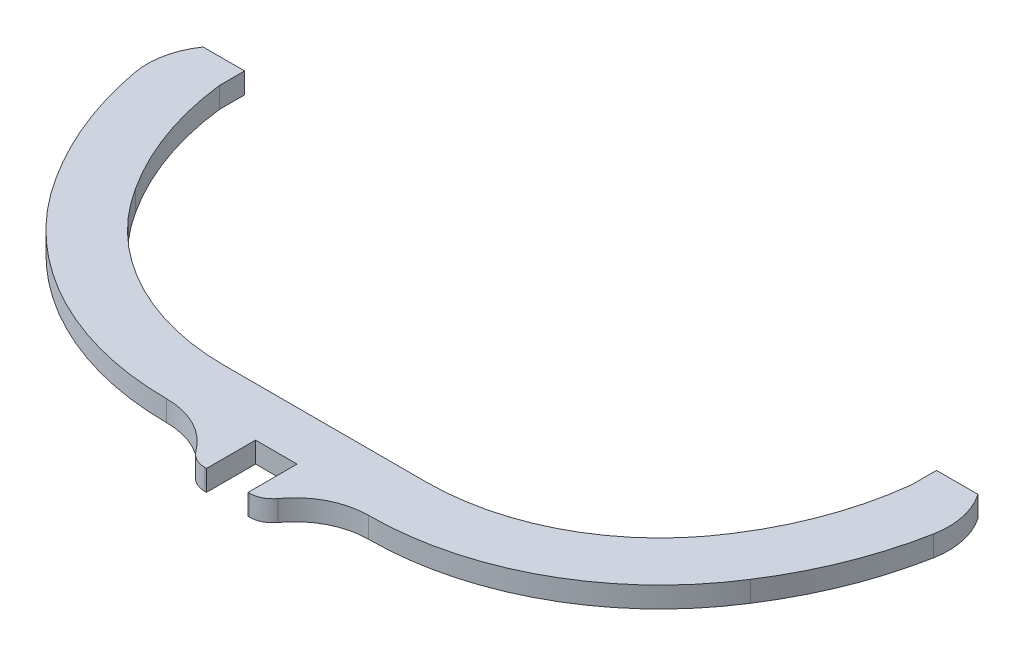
ISO-10303-21;
HEADER;
FILE_DESCRIPTION(('STEP AP214'),'2;1');
FILE_NAME('part.step','',(''),(''),'','','');
FILE_SCHEMA(('AUTOMOTIVE_DESIGN { 1 0 10303 214 1 1 1 1 }'));
ENDSEC;
DATA;
#1=APPLICATION_CONTEXT('core data for automotive mechanical design processes');
#2=APPLICATION_PROTOCOL_DEFINITION('international standard','automotive_design',2000,#1);
#3=PRODUCT_CONTEXT('',#1,'mechanical');
#4=PRODUCT('Part','Part','',(#3));
#5=PRODUCT_RELATED_PRODUCT_CATEGORY('part','',(#4));
#6=PRODUCT_DEFINITION_FORMATION('','',#4);
#7=PRODUCT_DEFINITION_CONTEXT('part definition',#1,'design');
#8=PRODUCT_DEFINITION('design','',#6,#7);
#9=PRODUCT_DEFINITION_SHAPE('','',#8);
#10=(LENGTH_UNIT() NAMED_UNIT(*) SI_UNIT(.MILLI.,.METRE.));
#11=(NAMED_UNIT(*) PLANE_ANGLE_UNIT() SI_UNIT($,.RADIAN.));
#12=(NAMED_UNIT(*) SI_UNIT($,.STERADIAN.) SOLID_ANGLE_UNIT());
#13=UNCERTAINTY_MEASURE_WITH_UNIT(LENGTH_MEASURE(1.E-05),#10,'distance_accuracy_value','');
#14=(GEOMETRIC_REPRESENTATION_CONTEXT(3) GLOBAL_UNCERTAINTY_ASSIGNED_CONTEXT((#13)) GLOBAL_UNIT_ASSIGNED_CONTEXT((#10,
#11,#12)) REPRESENTATION_CONTEXT('',''));
#15=CARTESIAN_POINT('',(0.,0.,0.));
#16=DIRECTION('',(0.,0.,1.));
#17=DIRECTION('',(1.,0.,0.));
#18=AXIS2_PLACEMENT_3D('',#15,#16,#17);
#19=CARTESIAN_POINT('',(35.9135850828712,9.,210.916782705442));
#20=DIRECTION('',(0.,-1.,0.));
#21=DIRECTION('',(0.,0.,-1.));
#22=AXIS2_PLACEMENT_3D('',#19,#20,#21);
#23=CYLINDRICAL_SURFACE('',#22,265.895482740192);
#24=CARTESIAN_POINT('',(35.9135850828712,-9.,210.916782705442));
#25=DIRECTION('',(0.,-1.,0.));
#26=DIRECTION('',(0.,0.,-1.));
#27=AXIS2_PLACEMENT_3D('',#24,#25,#26);
#28=CIRCLE('',#27,265.895482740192);
#29=CARTESIAN_POINT('',(300.,-9.,241.880845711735));
#30=VERTEX_POINT('',#29);
#31=CARTESIAN_POINT('',(259.051263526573,-9.,355.519632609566));
#32=VERTEX_POINT('',#31);
#33=EDGE_CURVE('E225',#30,#32,#28,.T.);
#34=ORIENTED_EDGE('',*,*,#33,.T.);
#35=DIRECTION('',(0.,-1.,0.));
#36=VECTOR('',#35,1.);
#37=CARTESIAN_POINT('',(259.051263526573,9.,355.519632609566));
#38=LINE('',#37,#36);
#39=CARTESIAN_POINT('',(259.051263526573,9.,355.519632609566));
#40=VERTEX_POINT('',#39);
#41=EDGE_CURVE('E11',#40,#32,#38,.T.);
#42=ORIENTED_EDGE('',*,*,#41,.F.);
#43=CARTESIAN_POINT('',(35.9135850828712,9.,210.916782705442));
#44=DIRECTION('',(0.,-1.,0.));
#45=DIRECTION('',(0.,0.,-1.));
#46=AXIS2_PLACEMENT_3D('',#43,#44,#45);
#47=CIRCLE('',#46,265.895482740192);
#48=CARTESIAN_POINT('',(300.,9.,241.880845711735));
#49=VERTEX_POINT('',#48);
#50=EDGE_CURVE('E271',#49,#40,#47,.T.);
#51=ORIENTED_EDGE('',*,*,#50,.F.);
#52=DIRECTION('',(0.,-1.,0.));
#53=VECTOR('',#52,1.);
#54=CARTESIAN_POINT('',(300.,9.,241.880845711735));
#55=LINE('',#54,#53);
#56=EDGE_CURVE('E221',#49,#30,#55,.T.);
#57=ORIENTED_EDGE('',*,*,#56,.T.);
#58=EDGE_LOOP('',(#34,#42,#51,#57));
#59=FACE_BOUND('',#58,.T.);
#60=ADVANCED_FACE('F33',(#59),#23,.F.);
#61=CARTESIAN_POINT('',(87.5793017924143,9.,247.157999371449));
#62=DIRECTION('',(0.,-1.,0.));
#63=DIRECTION('',(0.,0.,-1.));
#64=AXIS2_PLACEMENT_3D('',#61,#62,#63);
#65=CYLINDRICAL_SURFACE('',#64,202.842000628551);
#66=CARTESIAN_POINT('',(87.5793017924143,-9.,247.157999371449));
#67=DIRECTION('',(0.,-1.,0.));
#68=DIRECTION('',(0.,0.,-1.));
#69=AXIS2_PLACEMENT_3D('',#66,#67,#68);
#70=CIRCLE('',#69,202.842000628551);
#71=CARTESIAN_POINT('',(87.5793017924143,-9.,450.));
#72=VERTEX_POINT('',#71);
#73=EDGE_CURVE('E228',#32,#72,#70,.T.);
#74=ORIENTED_EDGE('',*,*,#73,.T.);
#75=DIRECTION('',(0.,-1.,0.));
#76=VECTOR('',#75,1.);
#77=CARTESIAN_POINT('',(87.5793017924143,9.,450.));
#78=LINE('',#77,#76);
#79=CARTESIAN_POINT('',(87.5793017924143,9.,450.));
#80=VERTEX_POINT('',#79);
#81=EDGE_CURVE('E41',#80,#72,#78,.T.);
#82=ORIENTED_EDGE('',*,*,#81,.F.);
#83=CARTESIAN_POINT('',(87.5793017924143,9.,247.157999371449));
#84=DIRECTION('',(0.,-1.,0.));
#85=DIRECTION('',(0.,0.,-1.));
#86=AXIS2_PLACEMENT_3D('',#83,#84,#85);
#87=CIRCLE('',#86,202.842000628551);
#88=EDGE_CURVE('E140',#40,#80,#87,.T.);
#89=ORIENTED_EDGE('',*,*,#88,.F.);
#90=ORIENTED_EDGE('',*,*,#41,.T.);
#91=EDGE_LOOP('',(#74,#82,#89,#90));
#92=FACE_BOUND('',#91,.T.);
#93=ADVANCED_FACE('F409',(#92),#65,.F.);
#94=CARTESIAN_POINT('',(87.5793017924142,9.,450.));
#95=DIRECTION('',(0.,0.,1.));
#96=DIRECTION('',(1.,0.,0.));
#97=AXIS2_PLACEMENT_3D('',#94,#95,#96);
#98=PLANE('',#97);
#99=DIRECTION('',(-1.,0.,0.));
#100=VECTOR('',#99,1.);
#101=CARTESIAN_POINT('',(87.5793017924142,-9.,450.));
#102=LINE('',#101,#100);
#103=CARTESIAN_POINT('',(-87.5793017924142,-9.,450.));
#104=VERTEX_POINT('',#103);
#105=EDGE_CURVE('E230',#72,#104,#102,.T.);
#106=ORIENTED_EDGE('',*,*,#105,.T.);
#107=DIRECTION('',(0.,-1.,0.));
#108=VECTOR('',#107,1.);
#109=CARTESIAN_POINT('',(-87.5793017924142,9.,450.));
#110=LINE('',#109,#108);
#111=CARTESIAN_POINT('',(-87.5793017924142,9.,450.));
#112=VERTEX_POINT('',#111);
#113=EDGE_CURVE('E326',#112,#104,#110,.T.);
#114=ORIENTED_EDGE('',*,*,#113,.F.);
#115=DIRECTION('',(-1.,0.,0.));
#116=VECTOR('',#115,1.);
#117=CARTESIAN_POINT('',(87.5793017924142,9.,450.));
#118=LINE('',#117,#116);
#119=EDGE_CURVE('E334',#80,#112,#118,.T.);
#120=ORIENTED_EDGE('',*,*,#119,.F.);
#121=ORIENTED_EDGE('',*,*,#81,.T.);
#122=EDGE_LOOP('',(#106,#114,#120,#121));
#123=FACE_BOUND('',#122,.T.);
#124=ADVANCED_FACE('F332',(#123),#98,.F.);
#125=CARTESIAN_POINT('',(-87.5793017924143,9.,247.157999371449));
#126=DIRECTION('',(0.,-1.,0.));
#127=DIRECTION('',(0.,0.,-1.));
#128=AXIS2_PLACEMENT_3D('',#125,#126,#127);
#129=CYLINDRICAL_SURFACE('',#128,202.842000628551);
#130=CARTESIAN_POINT('',(-87.5793017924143,-9.,247.157999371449));
#131=DIRECTION('',(0.,-1.,0.));
#132=DIRECTION('',(0.,0.,1.));
#133=AXIS2_PLACEMENT_3D('',#130,#131,#132);
#134=CIRCLE('',#133,202.842000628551);
#135=CARTESIAN_POINT('',(-259.051263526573,-9.,355.519632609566));
#136=VERTEX_POINT('',#135);
#137=EDGE_CURVE('E232',#104,#136,#134,.T.);
#138=ORIENTED_EDGE('',*,*,#137,.T.);
#139=DIRECTION('',(0.,-1.,0.));
#140=VECTOR('',#139,1.);
#141=CARTESIAN_POINT('',(-259.051263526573,9.,355.519632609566));
#142=LINE('',#141,#140);
#143=CARTESIAN_POINT('',(-259.051263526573,9.,355.519632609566));
#144=VERTEX_POINT('',#143);
#145=EDGE_CURVE('E323',#144,#136,#142,.T.);
#146=ORIENTED_EDGE('',*,*,#145,.F.);
#147=CARTESIAN_POINT('',(-87.5793017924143,9.,247.157999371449));
#148=DIRECTION('',(0.,-1.,0.));
#149=DIRECTION('',(0.,0.,1.));
#150=AXIS2_PLACEMENT_3D('',#147,#148,#149);
#151=CIRCLE('',#150,202.842000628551);
#152=EDGE_CURVE('E352',#112,#144,#151,.T.);
#153=ORIENTED_EDGE('',*,*,#152,.F.);
#154=ORIENTED_EDGE('',*,*,#113,.T.);
#155=EDGE_LOOP('',(#138,#146,#153,#154));
#156=FACE_BOUND('',#155,.T.);
#157=ADVANCED_FACE('F343',(#156),#129,.F.);
#158=CARTESIAN_POINT('',(-35.9135850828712,9.,210.916782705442));
#159=DIRECTION('',(0.,-1.,0.));
#160=DIRECTION('',(0.,0.,-1.));
#161=AXIS2_PLACEMENT_3D('',#158,#159,#160);
#162=CYLINDRICAL_SURFACE('',#161,265.895482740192);
#163=CARTESIAN_POINT('',(-35.9135850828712,-9.,210.916782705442));
#164=DIRECTION('',(0.,-1.,0.));
#165=DIRECTION('',(0.,0.,1.));
#166=AXIS2_PLACEMENT_3D('',#163,#164,#165);
#167=CIRCLE('',#166,265.895482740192);
#168=CARTESIAN_POINT('',(-300.,-9.,241.880845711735));
#169=VERTEX_POINT('',#168);
#170=EDGE_CURVE('E234',#136,#169,#167,.T.);
#171=ORIENTED_EDGE('',*,*,#170,.T.);
#172=DIRECTION('',(0.,-1.,0.));
#173=VECTOR('',#172,1.);
#174=CARTESIAN_POINT('',(-300.,9.,241.880845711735));
#175=LINE('',#174,#173);
#176=CARTESIAN_POINT('',(-300.,9.,241.880845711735));
#177=VERTEX_POINT('',#176);
#178=EDGE_CURVE('E320',#177,#169,#175,.T.);
#179=ORIENTED_EDGE('',*,*,#178,.F.);
#180=CARTESIAN_POINT('',(-35.9135850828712,9.,210.916782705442));
#181=DIRECTION('',(0.,-1.,0.));
#182=DIRECTION('',(0.,0.,1.));
#183=AXIS2_PLACEMENT_3D('',#180,#181,#182);
#184=CIRCLE('',#183,265.895482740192);
#185=EDGE_CURVE('E349',#144,#177,#184,.T.);
#186=ORIENTED_EDGE('',*,*,#185,.F.);
#187=ORIENTED_EDGE('',*,*,#145,.T.);
#188=EDGE_LOOP('',(#171,#179,#186,#187));
#189=FACE_BOUND('',#188,.T.);
#190=ADVANCED_FACE('F347',(#189),#162,.F.);
#191=CARTESIAN_POINT('',(-300.,9.,220.));
#192=DIRECTION('',(-1.,0.,0.));
#193=DIRECTION('',(0.,0.,1.));
#194=AXIS2_PLACEMENT_3D('',#191,#192,#193);
#195=PLANE('',#194);
#196=DIRECTION('',(0.,0.,-1.));
#197=VECTOR('',#196,1.);
#198=CARTESIAN_POINT('',(-300.,-9.,220.));
#199=LINE('',#198,#197);
#200=CARTESIAN_POINT('',(-300.,-9.,220.));
#201=VERTEX_POINT('',#200);
#202=EDGE_CURVE('E236',#169,#201,#199,.T.);
#203=ORIENTED_EDGE('',*,*,#202,.T.);
#204=DIRECTION('',(0.,-1.,0.));
#205=VECTOR('',#204,1.);
#206=CARTESIAN_POINT('',(-300.,9.,220.));
#207=LINE('',#206,#205);
#208=CARTESIAN_POINT('',(-300.,9.,220.));
#209=VERTEX_POINT('',#208);
#210=EDGE_CURVE('E317',#209,#201,#207,.T.);
#211=ORIENTED_EDGE('',*,*,#210,.F.);
#212=DIRECTION('',(0.,0.,-1.));
#213=VECTOR('',#212,1.);
#214=CARTESIAN_POINT('',(-300.,9.,220.));
#215=LINE('',#214,#213);
#216=EDGE_CURVE('E351',#177,#209,#215,.T.);
#217=ORIENTED_EDGE('',*,*,#216,.F.);
#218=ORIENTED_EDGE('',*,*,#178,.T.);
#219=EDGE_LOOP('',(#203,#211,#217,#218));
#220=FACE_BOUND('',#219,.T.);
#221=ADVANCED_FACE('F422',(#220),#195,.F.);
#222=CARTESIAN_POINT('',(-300.,9.,220.));
#223=DIRECTION('',(0.,0.,1.));
#224=DIRECTION('',(1.,0.,0.));
#225=AXIS2_PLACEMENT_3D('',#222,#223,#224);
#226=PLANE('',#225);
#227=DIRECTION('',(-1.,0.,0.));
#228=VECTOR('',#227,1.);
#229=CARTESIAN_POINT('',(-300.,-9.,220.));
#230=LINE('',#229,#228);
#231=CARTESIAN_POINT('',(-336.,-9.,220.));
#232=VERTEX_POINT('',#231);
#233=EDGE_CURVE('E238',#201,#232,#230,.T.);
#234=ORIENTED_EDGE('',*,*,#233,.T.);
#235=DIRECTION('',(0.,-1.,0.));
#236=VECTOR('',#235,1.);
#237=CARTESIAN_POINT('',(-336.,9.,220.));
#238=LINE('',#237,#236);
#239=CARTESIAN_POINT('',(-336.,9.,220.));
#240=VERTEX_POINT('',#239);
#241=EDGE_CURVE('E314',#240,#232,#238,.T.);
#242=ORIENTED_EDGE('',*,*,#241,.F.);
#243=DIRECTION('',(-1.,0.,0.));
#244=VECTOR('',#243,1.);
#245=CARTESIAN_POINT('',(-300.,9.,220.));
#246=LINE('',#245,#244);
#247=EDGE_CURVE('E354',#209,#240,#246,.T.);
#248=ORIENTED_EDGE('',*,*,#247,.F.);
#249=ORIENTED_EDGE('',*,*,#210,.T.);
#250=EDGE_LOOP('',(#234,#242,#248,#249));
#251=FACE_BOUND('',#250,.T.);
#252=ADVANCED_FACE('F425',(#251),#226,.F.);
#253=CARTESIAN_POINT('',(-282.577068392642,9.,256.972710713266));
#254=DIRECTION('',(0.,-1.,0.));
#255=DIRECTION('',(0.,0.,-1.));
#256=AXIS2_PLACEMENT_3D('',#253,#254,#255);
#257=CYLINDRICAL_SURFACE('',#256,64.9691539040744);
#258=CARTESIAN_POINT('',(-282.577068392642,-9.,256.972710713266));
#259=DIRECTION('',(0.,1.,0.));
#260=DIRECTION('',(0.,0.,-1.));
#261=AXIS2_PLACEMENT_3D('',#258,#259,#260);
#262=CIRCLE('',#261,64.9691539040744);
#263=CARTESIAN_POINT('',(-346.44249807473,-9.,268.897384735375));
#264=VERTEX_POINT('',#263);
#265=EDGE_CURVE('E240',#232,#264,#262,.T.);
#266=ORIENTED_EDGE('',*,*,#265,.T.);
#267=DIRECTION('',(0.,-1.,0.));
#268=VECTOR('',#267,1.);
#269=CARTESIAN_POINT('',(-346.44249807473,9.,268.897384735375));
#270=LINE('',#269,#268);
#271=CARTESIAN_POINT('',(-346.44249807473,9.,268.897384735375));
#272=VERTEX_POINT('',#271);
#273=EDGE_CURVE('E311',#272,#264,#270,.T.);
#274=ORIENTED_EDGE('',*,*,#273,.F.);
#275=CARTESIAN_POINT('',(-282.577068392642,9.,256.972710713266));
#276=DIRECTION('',(0.,1.,0.));
#277=DIRECTION('',(0.,0.,-1.));
#278=AXIS2_PLACEMENT_3D('',#275,#276,#277);
#279=CIRCLE('',#278,64.9691539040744);
#280=EDGE_CURVE('E360',#240,#272,#279,.T.);
#281=ORIENTED_EDGE('',*,*,#280,.F.);
#282=ORIENTED_EDGE('',*,*,#241,.T.);
#283=EDGE_LOOP('',(#266,#274,#281,#282));
#284=FACE_BOUND('',#283,.T.);
#285=ADVANCED_FACE('F429',(#284),#257,.T.);
#286=CARTESIAN_POINT('',(-35.9135850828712,9.,210.916782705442));
#287=DIRECTION('',(0.,-1.,0.));
#288=DIRECTION('',(0.,0.,-1.));
#289=AXIS2_PLACEMENT_3D('',#286,#287,#288);
#290=CYLINDRICAL_SURFACE('',#289,315.895482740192);
#291=CARTESIAN_POINT('',(-35.9135850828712,-9.,210.916782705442));
#292=DIRECTION('',(0.,1.,0.));
#293=DIRECTION('',(0.,0.,1.));
#294=AXIS2_PLACEMENT_3D('',#291,#292,#293);
#295=CIRCLE('',#294,315.895482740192);
#296=CARTESIAN_POINT('',(-301.164181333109,-9.,382.474578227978));
#297=VERTEX_POINT('',#296);
#298=EDGE_CURVE('E242',#264,#297,#295,.T.);
#299=ORIENTED_EDGE('',*,*,#298,.T.);
#300=DIRECTION('',(0.,-1.,0.));
#301=VECTOR('',#300,1.);
#302=CARTESIAN_POINT('',(-301.164181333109,9.,382.474578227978));
#303=LINE('',#302,#301);
#304=CARTESIAN_POINT('',(-301.164181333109,9.,382.474578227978));
#305=VERTEX_POINT('',#304);
#306=EDGE_CURVE('E308',#305,#297,#303,.T.);
#307=ORIENTED_EDGE('',*,*,#306,.F.);
#308=CARTESIAN_POINT('',(-35.9135850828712,9.,210.916782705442));
#309=DIRECTION('',(0.,1.,0.));
#310=DIRECTION('',(0.,0.,1.));
#311=AXIS2_PLACEMENT_3D('',#308,#309,#310);
#312=CIRCLE('',#311,315.895482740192);
#313=EDGE_CURVE('E362',#272,#305,#312,.T.);
#314=ORIENTED_EDGE('',*,*,#313,.F.);
#315=ORIENTED_EDGE('',*,*,#273,.T.);
#316=EDGE_LOOP('',(#299,#307,#314,#315));
#317=FACE_BOUND('',#316,.T.);
#318=ADVANCED_FACE('F433',(#317),#290,.T.);
#319=CARTESIAN_POINT('',(-87.5793017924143,9.,247.157999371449));
#320=DIRECTION('',(0.,-1.,0.));
#321=DIRECTION('',(0.,0.,-1.));
#322=AXIS2_PLACEMENT_3D('',#319,#320,#321);
#323=CYLINDRICAL_SURFACE('',#322,252.842000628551);
#324=CARTESIAN_POINT('',(-87.5793017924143,-9.,247.157999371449));
#325=DIRECTION('',(0.,1.,0.));
#326=DIRECTION('',(0.,0.,1.));
#327=AXIS2_PLACEMENT_3D('',#324,#325,#326);
#328=CIRCLE('',#327,252.842000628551);
#329=CARTESIAN_POINT('',(-87.5793017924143,-9.,500.));
#330=VERTEX_POINT('',#329);
#331=EDGE_CURVE('E244',#297,#330,#328,.T.);
#332=ORIENTED_EDGE('',*,*,#331,.T.);
#333=DIRECTION('',(0.,-1.,0.));
#334=VECTOR('',#333,1.);
#335=CARTESIAN_POINT('',(-87.5793017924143,9.,500.));
#336=LINE('',#335,#334);
#337=CARTESIAN_POINT('',(-87.5793017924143,9.,500.));
#338=VERTEX_POINT('',#337);
#339=EDGE_CURVE('E305',#338,#330,#336,.T.);
#340=ORIENTED_EDGE('',*,*,#339,.F.);
#341=CARTESIAN_POINT('',(-87.5793017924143,9.,247.157999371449));
#342=DIRECTION('',(0.,1.,0.));
#343=DIRECTION('',(0.,0.,1.));
#344=AXIS2_PLACEMENT_3D('',#341,#342,#343);
#345=CIRCLE('',#344,252.842000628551);
#346=EDGE_CURVE('E364',#305,#338,#345,.T.);
#347=ORIENTED_EDGE('',*,*,#346,.F.);
#348=ORIENTED_EDGE('',*,*,#306,.T.);
#349=EDGE_LOOP('',(#332,#340,#347,#348));
#350=FACE_BOUND('',#349,.T.);
#351=ADVANCED_FACE('F437',(#350),#323,.T.);
#352=CARTESIAN_POINT('',(-87.5793017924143,9.,563.982174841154));
#353=DIRECTION('',(0.,-1.,0.));
#354=DIRECTION('',(0.,0.,-1.));
#355=AXIS2_PLACEMENT_3D('',#352,#353,#354);
#356=CYLINDRICAL_SURFACE('',#355,63.9821748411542);
#357=CARTESIAN_POINT('',(-87.5793017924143,-9.,563.982174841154));
#358=DIRECTION('',(0.,-1.,0.));
#359=DIRECTION('',(0.,0.,-1.));
#360=AXIS2_PLACEMENT_3D('',#357,#358,#359);
#361=CIRCLE('',#360,63.9821748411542);
#362=CARTESIAN_POINT('',(-35.6068134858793,-9.,526.664897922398));
#363=VERTEX_POINT('',#362);
#364=EDGE_CURVE('E246',#330,#363,#361,.T.);
#365=ORIENTED_EDGE('',*,*,#364,.T.);
#366=DIRECTION('',(0.,-1.,0.));
#367=VECTOR('',#366,1.);
#368=CARTESIAN_POINT('',(-35.6068134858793,9.,526.664897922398));
#369=LINE('',#368,#367);
#370=CARTESIAN_POINT('',(-35.6068134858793,9.,526.664897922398));
#371=VERTEX_POINT('',#370);
#372=EDGE_CURVE('E302',#371,#363,#369,.T.);
#373=ORIENTED_EDGE('',*,*,#372,.F.);
#374=CARTESIAN_POINT('',(-87.5793017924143,9.,563.982174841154));
#375=DIRECTION('',(0.,-1.,0.));
#376=DIRECTION('',(0.,0.,-1.));
#377=AXIS2_PLACEMENT_3D('',#374,#375,#376);
#378=CIRCLE('',#377,63.9821748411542);
#379=EDGE_CURVE('E366',#338,#371,#378,.T.);
#380=ORIENTED_EDGE('',*,*,#379,.F.);
#381=ORIENTED_EDGE('',*,*,#339,.T.);
#382=EDGE_LOOP('',(#365,#373,#380,#381));
#383=FACE_BOUND('',#382,.T.);
#384=ADVANCED_FACE('F441',(#383),#356,.F.);
#385=CARTESIAN_POINT('',(-19.360886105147,9.,515.));
#386=DIRECTION('',(0.,-1.,0.));
#387=DIRECTION('',(0.,0.,-1.));
#388=AXIS2_PLACEMENT_3D('',#385,#386,#387);
#389=CYLINDRICAL_SURFACE('',#388,20.);
#390=CARTESIAN_POINT('',(-19.360886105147,-9.,515.));
#391=DIRECTION('',(0.,1.,0.));
#392=DIRECTION('',(0.,0.,-1.));
#393=AXIS2_PLACEMENT_3D('',#390,#391,#392);
#394=CIRCLE('',#393,20.);
#395=CARTESIAN_POINT('',(-19.360886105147,-9.,535.));
#396=VERTEX_POINT('',#395);
#397=EDGE_CURVE('E248',#363,#396,#394,.T.);
#398=ORIENTED_EDGE('',*,*,#397,.T.);
#399=DIRECTION('',(0.,-1.,0.));
#400=VECTOR('',#399,1.);
#401=CARTESIAN_POINT('',(-19.360886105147,9.,535.));
#402=LINE('',#401,#400);
#403=CARTESIAN_POINT('',(-19.360886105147,9.,535.));
#404=VERTEX_POINT('',#403);
#405=EDGE_CURVE('E299',#404,#396,#402,.T.);
#406=ORIENTED_EDGE('',*,*,#405,.F.);
#407=CARTESIAN_POINT('',(-19.360886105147,9.,515.));
#408=DIRECTION('',(0.,1.,0.));
#409=DIRECTION('',(0.,0.,-1.));
#410=AXIS2_PLACEMENT_3D('',#407,#408,#409);
#411=CIRCLE('',#410,20.);
#412=EDGE_CURVE('E368',#371,#404,#411,.T.);
#413=ORIENTED_EDGE('',*,*,#412,.F.);
#414=ORIENTED_EDGE('',*,*,#372,.T.);
#415=EDGE_LOOP('',(#398,#406,#413,#414));
#416=FACE_BOUND('',#415,.T.);
#417=ADVANCED_FACE('F445',(#416),#389,.T.);
#418=CARTESIAN_POINT('',(-18.,9.,535.));
#419=DIRECTION('',(0.,0.,-1.));
#420=DIRECTION('',(-1.,0.,0.));
#421=AXIS2_PLACEMENT_3D('',#418,#419,#420);
#422=PLANE('',#421);
#423=DIRECTION('',(1.,0.,0.));
#424=VECTOR('',#423,1.);
#425=CARTESIAN_POINT('',(-18.,-9.,535.));
#426=LINE('',#425,#424);
#427=CARTESIAN_POINT('',(-18.,-9.,535.));
#428=VERTEX_POINT('',#427);
#429=EDGE_CURVE('E250',#396,#428,#426,.T.);
#430=ORIENTED_EDGE('',*,*,#429,.T.);
#431=DIRECTION('',(0.,-1.,0.));
#432=VECTOR('',#431,1.);
#433=CARTESIAN_POINT('',(-18.,9.,535.));
#434=LINE('',#433,#432);
#435=CARTESIAN_POINT('',(-18.,9.,535.));
#436=VERTEX_POINT('',#435);
#437=EDGE_CURVE('E296',#436,#428,#434,.T.);
#438=ORIENTED_EDGE('',*,*,#437,.F.);
#439=DIRECTION('',(1.,0.,0.));
#440=VECTOR('',#439,1.);
#441=CARTESIAN_POINT('',(-18.,9.,535.));
#442=LINE('',#441,#440);
#443=EDGE_CURVE('E370',#404,#436,#442,.T.);
#444=ORIENTED_EDGE('',*,*,#443,.F.);
#445=ORIENTED_EDGE('',*,*,#405,.T.);
#446=EDGE_LOOP('',(#430,#438,#444,#445));
#447=FACE_BOUND('',#446,.T.);
#448=ADVANCED_FACE('F449',(#447),#422,.F.);
#449=CARTESIAN_POINT('',(-18.,9.,535.));
#450=DIRECTION('',(-1.,0.,0.));
#451=DIRECTION('',(0.,0.,1.));
#452=AXIS2_PLACEMENT_3D('',#449,#450,#451);
#453=PLANE('',#452);
#454=DIRECTION('',(0.,0.,-1.));
#455=VECTOR('',#454,1.);
#456=CARTESIAN_POINT('',(-18.,-9.,535.));
#457=LINE('',#456,#455);
#458=CARTESIAN_POINT('',(-18.,-9.,492.5));
#459=VERTEX_POINT('',#458);
#460=EDGE_CURVE('E252',#428,#459,#457,.T.);
#461=ORIENTED_EDGE('',*,*,#460,.T.);
#462=DIRECTION('',(0.,-1.,0.));
#463=VECTOR('',#462,1.);
#464=CARTESIAN_POINT('',(-18.,9.,492.5));
#465=LINE('',#464,#463);
#466=CARTESIAN_POINT('',(-18.,9.,492.5));
#467=VERTEX_POINT('',#466);
#468=EDGE_CURVE('E293',#467,#459,#465,.T.);
#469=ORIENTED_EDGE('',*,*,#468,.F.);
#470=DIRECTION('',(0.,0.,-1.));
#471=VECTOR('',#470,1.);
#472=CARTESIAN_POINT('',(-18.,9.,535.));
#473=LINE('',#472,#471);
#474=EDGE_CURVE('E372',#436,#467,#473,.T.);
#475=ORIENTED_EDGE('',*,*,#474,.F.);
#476=ORIENTED_EDGE('',*,*,#437,.T.);
#477=EDGE_LOOP('',(#461,#469,#475,#476));
#478=FACE_BOUND('',#477,.T.);
#479=ADVANCED_FACE('F453',(#478),#453,.F.);
#480=CARTESIAN_POINT('',(-18.,9.,492.5));
#481=DIRECTION('',(0.,0.,-1.));
#482=DIRECTION('',(-1.,0.,0.));
#483=AXIS2_PLACEMENT_3D('',#480,#481,#482);
#484=PLANE('',#483);
#485=DIRECTION('',(1.,0.,0.));
#486=VECTOR('',#485,1.);
#487=CARTESIAN_POINT('',(-18.,-9.,492.5));
#488=LINE('',#487,#486);
#489=CARTESIAN_POINT('',(18.,-9.,492.5));
#490=VERTEX_POINT('',#489);
#491=EDGE_CURVE('E254',#459,#490,#488,.T.);
#492=ORIENTED_EDGE('',*,*,#491,.T.);
#493=DIRECTION('',(0.,-1.,0.));
#494=VECTOR('',#493,1.);
#495=CARTESIAN_POINT('',(18.,9.,492.5));
#496=LINE('',#495,#494);
#497=CARTESIAN_POINT('',(18.,9.,492.5));
#498=VERTEX_POINT('',#497);
#499=EDGE_CURVE('E290',#498,#490,#496,.T.);
#500=ORIENTED_EDGE('',*,*,#499,.F.);
#501=DIRECTION('',(1.,0.,0.));
#502=VECTOR('',#501,1.);
#503=CARTESIAN_POINT('',(-18.,9.,492.5));
#504=LINE('',#503,#502);
#505=EDGE_CURVE('E374',#467,#498,#504,.T.);
#506=ORIENTED_EDGE('',*,*,#505,.F.);
#507=ORIENTED_EDGE('',*,*,#468,.T.);
#508=EDGE_LOOP('',(#492,#500,#506,#507));
#509=FACE_BOUND('',#508,.T.);
#510=ADVANCED_FACE('F457',(#509),#484,.F.);
#511=CARTESIAN_POINT('',(18.,9.,492.5));
#512=DIRECTION('',(1.,0.,0.));
#513=DIRECTION('',(0.,0.,-1.));
#514=AXIS2_PLACEMENT_3D('',#511,#512,#513);
#515=PLANE('',#514);
#516=DIRECTION('',(0.,0.,1.));
#517=VECTOR('',#516,1.);
#518=CARTESIAN_POINT('',(18.,-9.,492.5));
#519=LINE('',#518,#517);
#520=CARTESIAN_POINT('',(18.,-9.,535.));
#521=VERTEX_POINT('',#520);
#522=EDGE_CURVE('E256',#490,#521,#519,.T.);
#523=ORIENTED_EDGE('',*,*,#522,.T.);
#524=DIRECTION('',(0.,-1.,0.));
#525=VECTOR('',#524,1.);
#526=CARTESIAN_POINT('',(18.,9.,535.));
#527=LINE('',#526,#525);
#528=CARTESIAN_POINT('',(18.,9.,535.));
#529=VERTEX_POINT('',#528);
#530=EDGE_CURVE('E287',#529,#521,#527,.T.);
#531=ORIENTED_EDGE('',*,*,#530,.F.);
#532=DIRECTION('',(0.,0.,1.));
#533=VECTOR('',#532,1.);
#534=CARTESIAN_POINT('',(18.,9.,492.5));
#535=LINE('',#534,#533);
#536=EDGE_CURVE('E376',#498,#529,#535,.T.);
#537=ORIENTED_EDGE('',*,*,#536,.F.);
#538=ORIENTED_EDGE('',*,*,#499,.T.);
#539=EDGE_LOOP('',(#523,#531,#537,#538));
#540=FACE_BOUND('',#539,.T.);
#541=ADVANCED_FACE('F461',(#540),#515,.F.);
#542=CARTESIAN_POINT('',(19.360886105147,9.,535.));
#543=DIRECTION('',(0.,0.,-1.));
#544=DIRECTION('',(-1.,0.,0.));
#545=AXIS2_PLACEMENT_3D('',#542,#543,#544);
#546=PLANE('',#545);
#547=DIRECTION('',(1.,0.,0.));
#548=VECTOR('',#547,1.);
#549=CARTESIAN_POINT('',(19.360886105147,-9.,535.));
#550=LINE('',#549,#548);
#551=CARTESIAN_POINT('',(19.360886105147,-9.,535.));
#552=VERTEX_POINT('',#551);
#553=EDGE_CURVE('E258',#521,#552,#550,.T.);
#554=ORIENTED_EDGE('',*,*,#553,.T.);
#555=DIRECTION('',(0.,-1.,0.));
#556=VECTOR('',#555,1.);
#557=CARTESIAN_POINT('',(19.360886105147,9.,535.));
#558=LINE('',#557,#556);
#559=CARTESIAN_POINT('',(19.360886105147,9.,535.));
#560=VERTEX_POINT('',#559);
#561=EDGE_CURVE('E284',#560,#552,#558,.T.);
#562=ORIENTED_EDGE('',*,*,#561,.F.);
#563=DIRECTION('',(1.,0.,0.));
#564=VECTOR('',#563,1.);
#565=CARTESIAN_POINT('',(19.360886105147,9.,535.));
#566=LINE('',#565,#564);
#567=EDGE_CURVE('E378',#529,#560,#566,.T.);
#568=ORIENTED_EDGE('',*,*,#567,.F.);
#569=ORIENTED_EDGE('',*,*,#530,.T.);
#570=EDGE_LOOP('',(#554,#562,#568,#569));
#571=FACE_BOUND('',#570,.T.);
#572=ADVANCED_FACE('F465',(#571),#546,.F.);
#573=CARTESIAN_POINT('',(19.360886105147,9.,515.));
#574=DIRECTION('',(0.,-1.,0.));
#575=DIRECTION('',(0.,0.,-1.));
#576=AXIS2_PLACEMENT_3D('',#573,#574,#575);
#577=CYLINDRICAL_SURFACE('',#576,20.);
#578=CARTESIAN_POINT('',(19.360886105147,-9.,515.));
#579=DIRECTION('',(0.,1.,0.));
#580=DIRECTION('',(0.,0.,1.));
#581=AXIS2_PLACEMENT_3D('',#578,#579,#580);
#582=CIRCLE('',#581,20.);
#583=CARTESIAN_POINT('',(35.6068134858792,-9.,526.664897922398));
#584=VERTEX_POINT('',#583);
#585=EDGE_CURVE('E260',#552,#584,#582,.T.);
#586=ORIENTED_EDGE('',*,*,#585,.T.);
#587=DIRECTION('',(0.,-1.,0.));
#588=VECTOR('',#587,1.);
#589=CARTESIAN_POINT('',(35.6068134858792,9.,526.664897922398));
#590=LINE('',#589,#588);
#591=CARTESIAN_POINT('',(35.6068134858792,9.,526.664897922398));
#592=VERTEX_POINT('',#591);
#593=EDGE_CURVE('E281',#592,#584,#590,.T.);
#594=ORIENTED_EDGE('',*,*,#593,.F.);
#595=CARTESIAN_POINT('',(19.360886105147,9.,515.));
#596=DIRECTION('',(0.,1.,0.));
#597=DIRECTION('',(0.,0.,1.));
#598=AXIS2_PLACEMENT_3D('',#595,#596,#597);
#599=CIRCLE('',#598,20.);
#600=EDGE_CURVE('E380',#560,#592,#599,.T.);
#601=ORIENTED_EDGE('',*,*,#600,.F.);
#602=ORIENTED_EDGE('',*,*,#561,.T.);
#603=EDGE_LOOP('',(#586,#594,#601,#602));
#604=FACE_BOUND('',#603,.T.);
#605=ADVANCED_FACE('F469',(#604),#577,.T.);
#606=CARTESIAN_POINT('',(87.5793017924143,9.,563.982174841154));
#607=DIRECTION('',(0.,-1.,0.));
#608=DIRECTION('',(0.,0.,-1.));
#609=AXIS2_PLACEMENT_3D('',#606,#607,#608);
#610=CYLINDRICAL_SURFACE('',#609,63.9821748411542);
#611=CARTESIAN_POINT('',(87.5793017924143,-9.,563.982174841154));
#612=DIRECTION('',(0.,-1.,0.));
#613=DIRECTION('',(0.,0.,1.));
#614=AXIS2_PLACEMENT_3D('',#611,#612,#613);
#615=CIRCLE('',#614,63.9821748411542);
#616=CARTESIAN_POINT('',(87.5793017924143,-9.,500.));
#617=VERTEX_POINT('',#616);
#618=EDGE_CURVE('E262',#584,#617,#615,.T.);
#619=ORIENTED_EDGE('',*,*,#618,.T.);
#620=DIRECTION('',(0.,-1.,0.));
#621=VECTOR('',#620,1.);
#622=CARTESIAN_POINT('',(87.5793017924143,9.,500.));
#623=LINE('',#622,#621);
#624=CARTESIAN_POINT('',(87.5793017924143,9.,500.));
#625=VERTEX_POINT('',#624);
#626=EDGE_CURVE('E278',#625,#617,#623,.T.);
#627=ORIENTED_EDGE('',*,*,#626,.F.);
#628=CARTESIAN_POINT('',(87.5793017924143,9.,563.982174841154));
#629=DIRECTION('',(0.,-1.,0.));
#630=DIRECTION('',(0.,0.,1.));
#631=AXIS2_PLACEMENT_3D('',#628,#629,#630);
#632=CIRCLE('',#631,63.9821748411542);
#633=EDGE_CURVE('E382',#592,#625,#632,.T.);
#634=ORIENTED_EDGE('',*,*,#633,.F.);
#635=ORIENTED_EDGE('',*,*,#593,.T.);
#636=EDGE_LOOP('',(#619,#627,#634,#635));
#637=FACE_BOUND('',#636,.T.);
#638=ADVANCED_FACE('F473',(#637),#610,.F.);
#639=CARTESIAN_POINT('',(87.5793017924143,9.,247.157999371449));
#640=DIRECTION('',(0.,-1.,0.));
#641=DIRECTION('',(0.,0.,-1.));
#642=AXIS2_PLACEMENT_3D('',#639,#640,#641);
#643=CYLINDRICAL_SURFACE('',#642,252.842000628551);
#644=CARTESIAN_POINT('',(87.5793017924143,-9.,247.157999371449));
#645=DIRECTION('',(0.,1.,0.));
#646=DIRECTION('',(0.,0.,-1.));
#647=AXIS2_PLACEMENT_3D('',#644,#645,#646);
#648=CIRCLE('',#647,252.842000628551);
#649=CARTESIAN_POINT('',(301.164181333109,-9.,382.474578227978));
#650=VERTEX_POINT('',#649);
#651=EDGE_CURVE('E264',#617,#650,#648,.T.);
#652=ORIENTED_EDGE('',*,*,#651,.T.);
#653=DIRECTION('',(0.,-1.,0.));
#654=VECTOR('',#653,1.);
#655=CARTESIAN_POINT('',(301.164181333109,9.,382.474578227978));
#656=LINE('',#655,#654);
#657=CARTESIAN_POINT('',(301.164181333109,9.,382.474578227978));
#658=VERTEX_POINT('',#657);
#659=EDGE_CURVE('E275',#658,#650,#656,.T.);
#660=ORIENTED_EDGE('',*,*,#659,.F.);
#661=CARTESIAN_POINT('',(87.5793017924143,9.,247.157999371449));
#662=DIRECTION('',(0.,1.,0.));
#663=DIRECTION('',(0.,0.,-1.));
#664=AXIS2_PLACEMENT_3D('',#661,#662,#663);
#665=CIRCLE('',#664,252.842000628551);
#666=EDGE_CURVE('E384',#625,#658,#665,.T.);
#667=ORIENTED_EDGE('',*,*,#666,.F.);
#668=ORIENTED_EDGE('',*,*,#626,.T.);
#669=EDGE_LOOP('',(#652,#660,#667,#668));
#670=FACE_BOUND('',#669,.T.);
#671=ADVANCED_FACE('F390',(#670),#643,.T.);
#672=CARTESIAN_POINT('',(35.9135850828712,9.,210.916782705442));
#673=DIRECTION('',(0.,-1.,0.));
#674=DIRECTION('',(0.,0.,-1.));
#675=AXIS2_PLACEMENT_3D('',#672,#673,#674);
#676=CYLINDRICAL_SURFACE('',#675,315.895482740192);
#677=CARTESIAN_POINT('',(35.9135850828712,-9.,210.916782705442));
#678=DIRECTION('',(0.,1.,0.));
#679=DIRECTION('',(0.,0.,-1.));
#680=AXIS2_PLACEMENT_3D('',#677,#678,#679);
#681=CIRCLE('',#680,315.895482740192);
#682=CARTESIAN_POINT('',(346.44249807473,-9.,268.897384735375));
#683=VERTEX_POINT('',#682);
#684=EDGE_CURVE('E266',#650,#683,#681,.T.);
#685=ORIENTED_EDGE('',*,*,#684,.T.);
#686=DIRECTION('',(0.,-1.,0.));
#687=VECTOR('',#686,1.);
#688=CARTESIAN_POINT('',(346.44249807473,9.,268.897384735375));
#689=LINE('',#688,#687);
#690=CARTESIAN_POINT('',(346.44249807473,9.,268.897384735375));
#691=VERTEX_POINT('',#690);
#692=EDGE_CURVE('E216',#691,#683,#689,.T.);
#693=ORIENTED_EDGE('',*,*,#692,.F.);
#694=CARTESIAN_POINT('',(35.9135850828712,9.,210.916782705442));
#695=DIRECTION('',(0.,1.,0.));
#696=DIRECTION('',(0.,0.,-1.));
#697=AXIS2_PLACEMENT_3D('',#694,#695,#696);
#698=CIRCLE('',#697,315.895482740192);
#699=EDGE_CURVE('E207',#658,#691,#698,.T.);
#700=ORIENTED_EDGE('',*,*,#699,.F.);
#701=ORIENTED_EDGE('',*,*,#659,.T.);
#702=EDGE_LOOP('',(#685,#693,#700,#701));
#703=FACE_BOUND('',#702,.T.);
#704=ADVANCED_FACE('F394',(#703),#676,.T.);
#705=CARTESIAN_POINT('',(282.577068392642,9.,256.972710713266));
#706=DIRECTION('',(0.,-1.,0.));
#707=DIRECTION('',(0.,0.,-1.));
#708=AXIS2_PLACEMENT_3D('',#705,#706,#707);
#709=CYLINDRICAL_SURFACE('',#708,64.9691539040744);
#710=CARTESIAN_POINT('',(282.577068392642,-9.,256.972710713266));
#711=DIRECTION('',(0.,1.,0.));
#712=DIRECTION('',(0.,0.,1.));
#713=AXIS2_PLACEMENT_3D('',#710,#711,#712);
#714=CIRCLE('',#713,64.9691539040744);
#715=CARTESIAN_POINT('',(336.,-9.,220.));
#716=VERTEX_POINT('',#715);
#717=EDGE_CURVE('E215',#683,#716,#714,.T.);
#718=ORIENTED_EDGE('',*,*,#717,.T.);
#719=DIRECTION('',(0.,-1.,0.));
#720=VECTOR('',#719,1.);
#721=CARTESIAN_POINT('',(336.,9.,220.));
#722=LINE('',#721,#720);
#723=CARTESIAN_POINT('',(336.,9.,220.));
#724=VERTEX_POINT('',#723);
#725=EDGE_CURVE('E212',#724,#716,#722,.T.);
#726=ORIENTED_EDGE('',*,*,#725,.F.);
#727=CARTESIAN_POINT('',(282.577068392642,9.,256.972710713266));
#728=DIRECTION('',(0.,1.,0.));
#729=DIRECTION('',(0.,0.,1.));
#730=AXIS2_PLACEMENT_3D('',#727,#728,#729);
#731=CIRCLE('',#730,64.9691539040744);
#732=EDGE_CURVE('E201',#691,#724,#731,.T.);
#733=ORIENTED_EDGE('',*,*,#732,.F.);
#734=ORIENTED_EDGE('',*,*,#692,.T.);
#735=EDGE_LOOP('',(#718,#726,#733,#734));
#736=FACE_BOUND('',#735,.T.);
#737=ADVANCED_FACE('F213',(#736),#709,.T.);
#738=CARTESIAN_POINT('',(300.,9.,220.));
#739=DIRECTION('',(0.,0.,1.));
#740=DIRECTION('',(1.,0.,0.));
#741=AXIS2_PLACEMENT_3D('',#738,#739,#740);
#742=PLANE('',#741);
#743=DIRECTION('',(-1.,0.,0.));
#744=VECTOR('',#743,1.);
#745=CARTESIAN_POINT('',(300.,-9.,220.));
#746=LINE('',#745,#744);
#747=CARTESIAN_POINT('',(300.,-9.,220.));
#748=VERTEX_POINT('',#747);
#749=EDGE_CURVE('E126',#716,#748,#746,.T.);
#750=ORIENTED_EDGE('',*,*,#749,.T.);
#751=DIRECTION('',(0.,-1.,0.));
#752=VECTOR('',#751,1.);
#753=CARTESIAN_POINT('',(300.,9.,220.));
#754=LINE('',#753,#752);
#755=CARTESIAN_POINT('',(300.,9.,220.));
#756=VERTEX_POINT('',#755);
#757=EDGE_CURVE('E217',#756,#748,#754,.T.);
#758=ORIENTED_EDGE('',*,*,#757,.F.);
#759=DIRECTION('',(-1.,0.,0.));
#760=VECTOR('',#759,1.);
#761=CARTESIAN_POINT('',(300.,9.,220.));
#762=LINE('',#761,#760);
#763=EDGE_CURVE('E205',#724,#756,#762,.T.);
#764=ORIENTED_EDGE('',*,*,#763,.F.);
#765=ORIENTED_EDGE('',*,*,#725,.T.);
#766=EDGE_LOOP('',(#750,#758,#764,#765));
#767=FACE_BOUND('',#766,.T.);
#768=ADVANCED_FACE('F219',(#767),#742,.F.);
#769=CARTESIAN_POINT('',(300.,9.,220.));
#770=DIRECTION('',(1.,0.,0.));
#771=DIRECTION('',(0.,0.,-1.));
#772=AXIS2_PLACEMENT_3D('',#769,#770,#771);
#773=PLANE('',#772);
#774=DIRECTION('',(0.,0.,1.));
#775=VECTOR('',#774,1.);
#776=CARTESIAN_POINT('',(300.,-9.,220.));
#777=LINE('',#776,#775);
#778=EDGE_CURVE('E132',#748,#30,#777,.T.);
#779=ORIENTED_EDGE('',*,*,#778,.T.);
#780=ORIENTED_EDGE('',*,*,#56,.F.);
#781=DIRECTION('',(0.,0.,1.));
#782=VECTOR('',#781,1.);
#783=CARTESIAN_POINT('',(300.,9.,220.));
#784=LINE('',#783,#782);
#785=EDGE_CURVE('E49',#756,#49,#784,.T.);
#786=ORIENTED_EDGE('',*,*,#785,.F.);
#787=ORIENTED_EDGE('',*,*,#757,.T.);
#788=EDGE_LOOP('',(#779,#780,#786,#787));
#789=FACE_BOUND('',#788,.T.);
#790=ADVANCED_FACE('F398',(#789),#773,.F.);
#791=CARTESIAN_POINT('',(35.9135850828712,9.,210.916782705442));
#792=DIRECTION('',(0.,-1.,0.));
#793=DIRECTION('',(0.,0.,-1.));
#794=AXIS2_PLACEMENT_3D('',#791,#792,#793);
#795=PLANE('',#794);
#796=ORIENTED_EDGE('',*,*,#50,.T.);
#797=ORIENTED_EDGE('',*,*,#88,.T.);
#798=ORIENTED_EDGE('',*,*,#119,.T.);
#799=ORIENTED_EDGE('',*,*,#152,.T.);
#800=ORIENTED_EDGE('',*,*,#185,.T.);
#801=ORIENTED_EDGE('',*,*,#216,.T.);
#802=ORIENTED_EDGE('',*,*,#247,.T.);
#803=ORIENTED_EDGE('',*,*,#280,.T.);
#804=ORIENTED_EDGE('',*,*,#313,.T.);
#805=ORIENTED_EDGE('',*,*,#346,.T.);
#806=ORIENTED_EDGE('',*,*,#379,.T.);
#807=ORIENTED_EDGE('',*,*,#412,.T.);
#808=ORIENTED_EDGE('',*,*,#443,.T.);
#809=ORIENTED_EDGE('',*,*,#474,.T.);
#810=ORIENTED_EDGE('',*,*,#505,.T.);
#811=ORIENTED_EDGE('',*,*,#536,.T.);
#812=ORIENTED_EDGE('',*,*,#567,.T.);
#813=ORIENTED_EDGE('',*,*,#600,.T.);
#814=ORIENTED_EDGE('',*,*,#633,.T.);
#815=ORIENTED_EDGE('',*,*,#666,.T.);
#816=ORIENTED_EDGE('',*,*,#699,.T.);
#817=ORIENTED_EDGE('',*,*,#732,.T.);
#818=ORIENTED_EDGE('',*,*,#763,.T.);
#819=ORIENTED_EDGE('',*,*,#785,.T.);
#820=EDGE_LOOP('',(#796,#797,#798,#799,#800,#801,#802,#803,#804,#805,#806,#807,#808,#809,#810,
#811,#812,#813,#814,#815,#816,#817,#818,#819));
#821=FACE_BOUND('',#820,.T.);
#822=ADVANCED_FACE('F203',(#821),#795,.F.);
#823=CARTESIAN_POINT('',(35.9135850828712,-9.,210.916782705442));
#824=DIRECTION('',(0.,-1.,0.));
#825=DIRECTION('',(0.,0.,-1.));
#826=AXIS2_PLACEMENT_3D('',#823,#824,#825);
#827=PLANE('',#826);
#828=ORIENTED_EDGE('',*,*,#33,.F.);
#829=ORIENTED_EDGE('',*,*,#778,.F.);
#830=ORIENTED_EDGE('',*,*,#749,.F.);
#831=ORIENTED_EDGE('',*,*,#717,.F.);
#832=ORIENTED_EDGE('',*,*,#684,.F.);
#833=ORIENTED_EDGE('',*,*,#651,.F.);
#834=ORIENTED_EDGE('',*,*,#618,.F.);
#835=ORIENTED_EDGE('',*,*,#585,.F.);
#836=ORIENTED_EDGE('',*,*,#553,.F.);
#837=ORIENTED_EDGE('',*,*,#522,.F.);
#838=ORIENTED_EDGE('',*,*,#491,.F.);
#839=ORIENTED_EDGE('',*,*,#460,.F.);
#840=ORIENTED_EDGE('',*,*,#429,.F.);
#841=ORIENTED_EDGE('',*,*,#397,.F.);
#842=ORIENTED_EDGE('',*,*,#364,.F.);
#843=ORIENTED_EDGE('',*,*,#331,.F.);
#844=ORIENTED_EDGE('',*,*,#298,.F.);
#845=ORIENTED_EDGE('',*,*,#265,.F.);
#846=ORIENTED_EDGE('',*,*,#233,.F.);
#847=ORIENTED_EDGE('',*,*,#202,.F.);
#848=ORIENTED_EDGE('',*,*,#170,.F.);
#849=ORIENTED_EDGE('',*,*,#137,.F.);
#850=ORIENTED_EDGE('',*,*,#105,.F.);
#851=ORIENTED_EDGE('',*,*,#73,.F.);
#852=EDGE_LOOP('',(#828,#829,#830,#831,#832,#833,#834,#835,#836,#837,#838,#839,#840,#841,#842,
#843,#844,#845,#846,#847,#848,#849,#850,#851));
#853=FACE_BOUND('',#852,.T.);
#854=ADVANCED_FACE('F338',(#853),#827,.T.);
#855=CLOSED_SHELL('',(#60,#93,#124,#157,#190,#221,#252,#285,#318,#351,#384,#417,#448,#479,#510,
#541,#572,#605,#638,#671,#704,#737,#768,#790,#822,#854));
#856=MANIFOLD_SOLID_BREP('B2',#855);
#857=ADVANCED_BREP_SHAPE_REPRESENTATION('',(#18,#856),#14);
#858=SHAPE_DEFINITION_REPRESENTATION(#9,#857);
ENDSEC;
END-ISO-10303-21;
